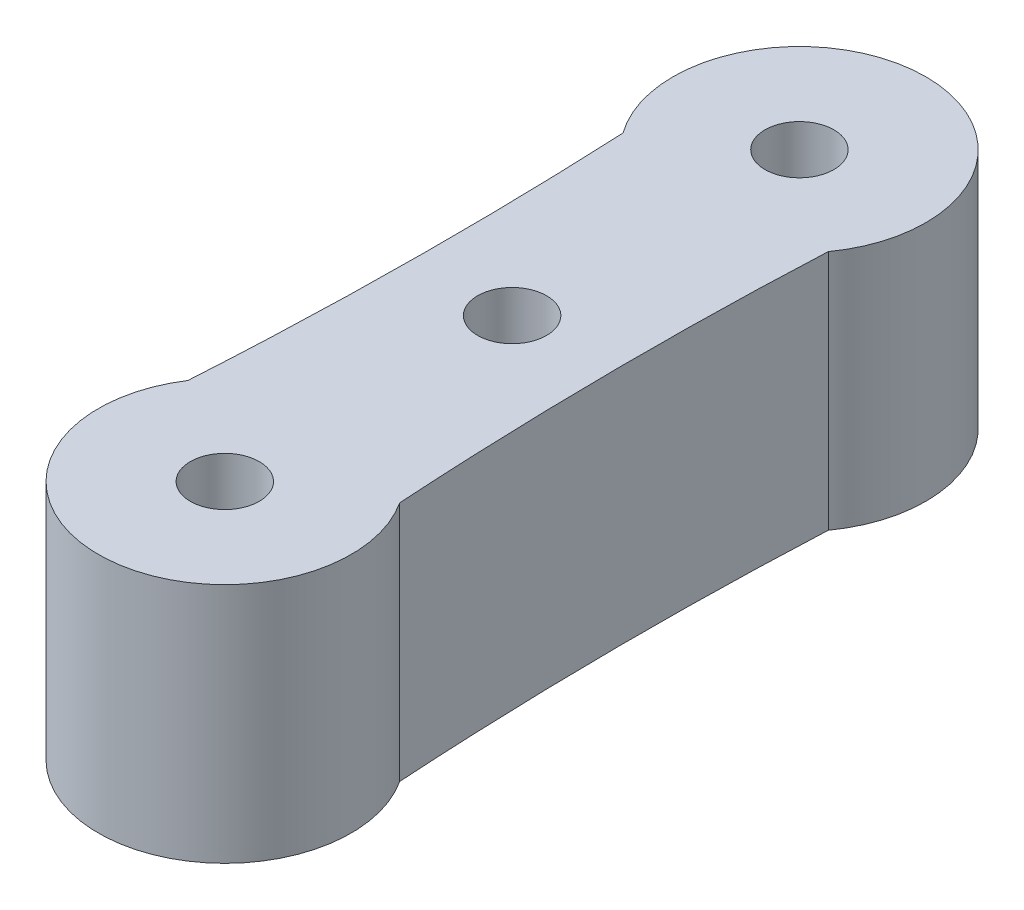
ISO-10303-21;
HEADER;
FILE_DESCRIPTION(('STEP AP214'),'2;1');
FILE_NAME('part.step','',(''),(''),'','','');
FILE_SCHEMA(('AUTOMOTIVE_DESIGN { 1 0 10303 214 1 1 1 1 }'));
ENDSEC;
DATA;
#1=APPLICATION_CONTEXT('core data for automotive mechanical design processes');
#2=APPLICATION_PROTOCOL_DEFINITION('international standard','automotive_design',2000,#1);
#3=PRODUCT_CONTEXT('',#1,'mechanical');
#4=PRODUCT('Part','Part','',(#3));
#5=PRODUCT_RELATED_PRODUCT_CATEGORY('part','',(#4));
#6=PRODUCT_DEFINITION_FORMATION('','',#4);
#7=PRODUCT_DEFINITION_CONTEXT('part definition',#1,'design');
#8=PRODUCT_DEFINITION('design','',#6,#7);
#9=PRODUCT_DEFINITION_SHAPE('','',#8);
#10=(LENGTH_UNIT() NAMED_UNIT(*) SI_UNIT(.MILLI.,.METRE.));
#11=(NAMED_UNIT(*) PLANE_ANGLE_UNIT() SI_UNIT($,.RADIAN.));
#12=(NAMED_UNIT(*) SI_UNIT($,.STERADIAN.) SOLID_ANGLE_UNIT());
#13=UNCERTAINTY_MEASURE_WITH_UNIT(LENGTH_MEASURE(1.E-05),#10,'distance_accuracy_value','');
#14=(GEOMETRIC_REPRESENTATION_CONTEXT(3) GLOBAL_UNCERTAINTY_ASSIGNED_CONTEXT((#13)) GLOBAL_UNIT_ASSIGNED_CONTEXT((#10,
#11,#12)) REPRESENTATION_CONTEXT('',''));
#15=CARTESIAN_POINT('',(0.,0.,0.));
#16=DIRECTION('',(0.,0.,1.));
#17=DIRECTION('',(1.,0.,0.));
#18=AXIS2_PLACEMENT_3D('',#15,#16,#17);
#19=CARTESIAN_POINT('',(0.,10.5,12.5));
#20=DIRECTION('',(0.,-1.,0.));
#21=DIRECTION('',(0.,0.,-1.));
#22=AXIS2_PLACEMENT_3D('',#19,#20,#21);
#23=CYLINDRICAL_SURFACE('',#22,1.5);
#24=CARTESIAN_POINT('',(0.,10.5,12.5));
#25=DIRECTION('',(0.,1.,0.));
#26=DIRECTION('',(0.,0.,1.));
#27=AXIS2_PLACEMENT_3D('',#24,#25,#26);
#28=CIRCLE('',#27,1.5);
#29=CARTESIAN_POINT('',(0.,10.5,11.));
#30=VERTEX_POINT('',#29);
#31=EDGE_CURVE('E293',#30,#30,#28,.T.);
#32=CARTESIAN_POINT('',(0.,3.5,12.5));
#33=DIRECTION('',(0.,-1.,0.));
#34=DIRECTION('',(0.,0.,-1.));
#35=AXIS2_PLACEMENT_3D('',#32,#33,#34);
#36=CIRCLE('',#35,1.5);
#37=CARTESIAN_POINT('',(0.,3.5,11.));
#38=VERTEX_POINT('',#37);
#39=EDGE_CURVE('E255',#38,#38,#36,.T.);
#40=CARTESIAN_POINT('',(0.,10.5,11.));
#41=CARTESIAN_POINT('',(0.,10.4270833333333,11.));
#42=CARTESIAN_POINT('',(0.,10.3541666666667,11.));
#43=CARTESIAN_POINT('',(0.,10.2083333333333,11.));
#44=CARTESIAN_POINT('',(0.,10.1354166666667,11.));
#45=CARTESIAN_POINT('',(0.,9.98958333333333,11.));
#46=CARTESIAN_POINT('',(0.,9.91666666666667,11.));
#47=CARTESIAN_POINT('',(0.,9.77083333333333,11.));
#48=CARTESIAN_POINT('',(0.,9.69791666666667,11.));
#49=CARTESIAN_POINT('',(0.,9.55208333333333,11.));
#50=CARTESIAN_POINT('',(0.,9.47916666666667,11.));
#51=CARTESIAN_POINT('',(0.,9.33333333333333,11.));
#52=CARTESIAN_POINT('',(0.,9.26041666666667,11.));
#53=CARTESIAN_POINT('',(0.,9.11458333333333,11.));
#54=CARTESIAN_POINT('',(0.,9.04166666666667,11.));
#55=CARTESIAN_POINT('',(0.,8.89583333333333,11.));
#56=CARTESIAN_POINT('',(0.,8.82291666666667,11.));
#57=CARTESIAN_POINT('',(0.,8.67708333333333,11.));
#58=CARTESIAN_POINT('',(0.,8.60416666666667,11.));
#59=CARTESIAN_POINT('',(0.,8.45833333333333,11.));
#60=CARTESIAN_POINT('',(0.,8.38541666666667,11.));
#61=CARTESIAN_POINT('',(0.,8.23958333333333,11.));
#62=CARTESIAN_POINT('',(0.,8.16666666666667,11.));
#63=CARTESIAN_POINT('',(0.,8.02083333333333,11.));
#64=CARTESIAN_POINT('',(0.,7.94791666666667,11.));
#65=CARTESIAN_POINT('',(0.,7.80208333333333,11.));
#66=CARTESIAN_POINT('',(0.,7.72916666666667,11.));
#67=CARTESIAN_POINT('',(0.,7.58333333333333,11.));
#68=CARTESIAN_POINT('',(0.,7.51041666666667,11.));
#69=CARTESIAN_POINT('',(0.,7.36458333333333,11.));
#70=CARTESIAN_POINT('',(0.,7.29166666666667,11.));
#71=CARTESIAN_POINT('',(0.,7.14583333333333,11.));
#72=CARTESIAN_POINT('',(0.,7.07291666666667,11.));
#73=CARTESIAN_POINT('',(0.,6.92708333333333,11.));
#74=CARTESIAN_POINT('',(0.,6.85416666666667,11.));
#75=CARTESIAN_POINT('',(0.,6.70833333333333,11.));
#76=CARTESIAN_POINT('',(0.,6.63541666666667,11.));
#77=CARTESIAN_POINT('',(0.,6.48958333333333,11.));
#78=CARTESIAN_POINT('',(0.,6.41666666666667,11.));
#79=CARTESIAN_POINT('',(0.,6.27083333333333,11.));
#80=CARTESIAN_POINT('',(0.,6.19791666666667,11.));
#81=CARTESIAN_POINT('',(0.,6.05208333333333,11.));
#82=CARTESIAN_POINT('',(0.,5.97916666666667,11.));
#83=CARTESIAN_POINT('',(0.,5.83333333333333,11.));
#84=CARTESIAN_POINT('',(0.,5.76041666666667,11.));
#85=CARTESIAN_POINT('',(0.,5.61458333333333,11.));
#86=CARTESIAN_POINT('',(0.,5.54166666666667,11.));
#87=CARTESIAN_POINT('',(0.,5.39583333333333,11.));
#88=CARTESIAN_POINT('',(0.,5.32291666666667,11.));
#89=CARTESIAN_POINT('',(0.,5.17708333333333,11.));
#90=CARTESIAN_POINT('',(0.,5.10416666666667,11.));
#91=CARTESIAN_POINT('',(0.,4.95833333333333,11.));
#92=CARTESIAN_POINT('',(0.,4.88541666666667,11.));
#93=CARTESIAN_POINT('',(0.,4.73958333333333,11.));
#94=CARTESIAN_POINT('',(0.,4.66666666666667,11.));
#95=CARTESIAN_POINT('',(0.,4.52083333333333,11.));
#96=CARTESIAN_POINT('',(0.,4.44791666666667,11.));
#97=CARTESIAN_POINT('',(0.,4.30208333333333,11.));
#98=CARTESIAN_POINT('',(0.,4.22916666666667,11.));
#99=CARTESIAN_POINT('',(0.,4.08333333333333,11.));
#100=CARTESIAN_POINT('',(0.,4.01041666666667,11.));
#101=CARTESIAN_POINT('',(0.,3.86458333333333,11.));
#102=CARTESIAN_POINT('',(0.,3.79166666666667,11.));
#103=CARTESIAN_POINT('',(0.,3.64583333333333,11.));
#104=CARTESIAN_POINT('',(0.,3.57291666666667,11.));
#105=CARTESIAN_POINT('',(0.,3.5,11.));
#106=B_SPLINE_CURVE_WITH_KNOTS('',3,(#40,#41,#42,#43,#44,#45,#46,#47,#48,#49,#50,#51,#52,#53,
#54,#55,#56,#57,#58,#59,#60,#61,#62,#63,#64,#65,#66,#67,#68,#69,#70,#71,#72,#73,#74,#75,#76,#77,
#78,#79,#80,#81,#82,#83,#84,#85,#86,#87,#88,#89,#90,#91,#92,#93,#94,#95,#96,#97,#98,#99,#100,
#101,#102,#103,#104,#105),.UNSPECIFIED.,.F.,.F.,(4,2,2,2,2,2,2,2,2,2,2,2,2,2,2,2,2,2,2,2,2,2,2,
2,2,2,2,2,2,2,2,2,4),(0.,0.21875,0.4375,0.656250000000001,0.875000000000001,1.09375,1.3125,
1.53125,1.75,1.96875,2.1875,2.40625,2.625,2.84375,3.0625,3.28125,3.5,3.71875,3.9375,4.15625,
4.375,4.59375,4.8125,5.03125,5.25,5.46875,5.6875,5.90625,6.125,6.34375,6.5625,6.78125,7.),.UNSPECIFIED.);
#107=EDGE_CURVE('BSEAM149',#30,#38,#106,.T.);
#108=ORIENTED_EDGE('',*,*,#31,.T.);
#109=ORIENTED_EDGE('',*,*,#39,.T.);
#110=ORIENTED_EDGE('',*,*,#107,.T.);
#111=ORIENTED_EDGE('',*,*,#107,.F.);
#112=EDGE_LOOP('',(#108,#110,#109,#111));
#113=FACE_BOUND('',#112,.T.);
#114=ADVANCED_FACE('F149',(#113),#23,.F.);
#115=CARTESIAN_POINT('',(0.,10.5,-12.5));
#116=DIRECTION('',(0.,-1.,0.));
#117=DIRECTION('',(0.,0.,-1.));
#118=AXIS2_PLACEMENT_3D('',#115,#116,#117);
#119=CYLINDRICAL_SURFACE('',#118,1.5);
#120=CARTESIAN_POINT('',(0.,10.5,-12.5));
#121=DIRECTION('',(0.,1.,0.));
#122=DIRECTION('',(0.,0.,1.));
#123=AXIS2_PLACEMENT_3D('',#120,#121,#122);
#124=CIRCLE('',#123,1.5);
#125=CARTESIAN_POINT('',(0.,10.5,-14.));
#126=VERTEX_POINT('',#125);
#127=EDGE_CURVE('E290',#126,#126,#124,.T.);
#128=CARTESIAN_POINT('',(0.,3.5,-12.5));
#129=DIRECTION('',(0.,-1.,0.));
#130=DIRECTION('',(0.,0.,-1.));
#131=AXIS2_PLACEMENT_3D('',#128,#129,#130);
#132=CIRCLE('',#131,1.5);
#133=CARTESIAN_POINT('',(0.,3.5,-14.));
#134=VERTEX_POINT('',#133);
#135=EDGE_CURVE('E248',#134,#134,#132,.T.);
#136=CARTESIAN_POINT('',(0.,10.5,-14.));
#137=CARTESIAN_POINT('',(0.,10.4270833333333,-14.));
#138=CARTESIAN_POINT('',(0.,10.3541666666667,-14.));
#139=CARTESIAN_POINT('',(0.,10.2083333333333,-14.));
#140=CARTESIAN_POINT('',(0.,10.1354166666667,-14.));
#141=CARTESIAN_POINT('',(0.,9.98958333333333,-14.));
#142=CARTESIAN_POINT('',(0.,9.91666666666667,-14.));
#143=CARTESIAN_POINT('',(0.,9.77083333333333,-14.));
#144=CARTESIAN_POINT('',(0.,9.69791666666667,-14.));
#145=CARTESIAN_POINT('',(0.,9.55208333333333,-14.));
#146=CARTESIAN_POINT('',(0.,9.47916666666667,-14.));
#147=CARTESIAN_POINT('',(0.,9.33333333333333,-14.));
#148=CARTESIAN_POINT('',(0.,9.26041666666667,-14.));
#149=CARTESIAN_POINT('',(0.,9.11458333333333,-14.));
#150=CARTESIAN_POINT('',(0.,9.04166666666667,-14.));
#151=CARTESIAN_POINT('',(0.,8.89583333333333,-14.));
#152=CARTESIAN_POINT('',(0.,8.82291666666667,-14.));
#153=CARTESIAN_POINT('',(0.,8.67708333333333,-14.));
#154=CARTESIAN_POINT('',(0.,8.60416666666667,-14.));
#155=CARTESIAN_POINT('',(0.,8.45833333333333,-14.));
#156=CARTESIAN_POINT('',(0.,8.38541666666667,-14.));
#157=CARTESIAN_POINT('',(0.,8.23958333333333,-14.));
#158=CARTESIAN_POINT('',(0.,8.16666666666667,-14.));
#159=CARTESIAN_POINT('',(0.,8.02083333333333,-14.));
#160=CARTESIAN_POINT('',(0.,7.94791666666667,-14.));
#161=CARTESIAN_POINT('',(0.,7.80208333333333,-14.));
#162=CARTESIAN_POINT('',(0.,7.72916666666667,-14.));
#163=CARTESIAN_POINT('',(0.,7.58333333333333,-14.));
#164=CARTESIAN_POINT('',(0.,7.51041666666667,-14.));
#165=CARTESIAN_POINT('',(0.,7.36458333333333,-14.));
#166=CARTESIAN_POINT('',(0.,7.29166666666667,-14.));
#167=CARTESIAN_POINT('',(0.,7.14583333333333,-14.));
#168=CARTESIAN_POINT('',(0.,7.07291666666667,-14.));
#169=CARTESIAN_POINT('',(0.,6.92708333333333,-14.));
#170=CARTESIAN_POINT('',(0.,6.85416666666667,-14.));
#171=CARTESIAN_POINT('',(0.,6.70833333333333,-14.));
#172=CARTESIAN_POINT('',(0.,6.63541666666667,-14.));
#173=CARTESIAN_POINT('',(0.,6.48958333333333,-14.));
#174=CARTESIAN_POINT('',(0.,6.41666666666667,-14.));
#175=CARTESIAN_POINT('',(0.,6.27083333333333,-14.));
#176=CARTESIAN_POINT('',(0.,6.19791666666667,-14.));
#177=CARTESIAN_POINT('',(0.,6.05208333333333,-14.));
#178=CARTESIAN_POINT('',(0.,5.97916666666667,-14.));
#179=CARTESIAN_POINT('',(0.,5.83333333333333,-14.));
#180=CARTESIAN_POINT('',(0.,5.76041666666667,-14.));
#181=CARTESIAN_POINT('',(0.,5.61458333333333,-14.));
#182=CARTESIAN_POINT('',(0.,5.54166666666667,-14.));
#183=CARTESIAN_POINT('',(0.,5.39583333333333,-14.));
#184=CARTESIAN_POINT('',(0.,5.32291666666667,-14.));
#185=CARTESIAN_POINT('',(0.,5.17708333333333,-14.));
#186=CARTESIAN_POINT('',(0.,5.10416666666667,-14.));
#187=CARTESIAN_POINT('',(0.,4.95833333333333,-14.));
#188=CARTESIAN_POINT('',(0.,4.88541666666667,-14.));
#189=CARTESIAN_POINT('',(0.,4.73958333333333,-14.));
#190=CARTESIAN_POINT('',(0.,4.66666666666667,-14.));
#191=CARTESIAN_POINT('',(0.,4.52083333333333,-14.));
#192=CARTESIAN_POINT('',(0.,4.44791666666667,-14.));
#193=CARTESIAN_POINT('',(0.,4.30208333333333,-14.));
#194=CARTESIAN_POINT('',(0.,4.22916666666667,-14.));
#195=CARTESIAN_POINT('',(0.,4.08333333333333,-14.));
#196=CARTESIAN_POINT('',(0.,4.01041666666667,-14.));
#197=CARTESIAN_POINT('',(0.,3.86458333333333,-14.));
#198=CARTESIAN_POINT('',(0.,3.79166666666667,-14.));
#199=CARTESIAN_POINT('',(0.,3.64583333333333,-14.));
#200=CARTESIAN_POINT('',(0.,3.57291666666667,-14.));
#201=CARTESIAN_POINT('',(0.,3.5,-14.));
#202=B_SPLINE_CURVE_WITH_KNOTS('',3,(#136,#137,#138,#139,#140,#141,#142,#143,#144,#145,#146,
#147,#148,#149,#150,#151,#152,#153,#154,#155,#156,#157,#158,#159,#160,#161,#162,#163,#164,#165,
#166,#167,#168,#169,#170,#171,#172,#173,#174,#175,#176,#177,#178,#179,#180,#181,#182,#183,#184,
#185,#186,#187,#188,#189,#190,#191,#192,#193,#194,#195,#196,#197,#198,#199,#200,#201),
.UNSPECIFIED.,.F.,.F.,(4,2,2,2,2,2,2,2,2,2,2,2,2,2,2,2,2,2,2,2,2,2,2,2,2,2,2,2,2,2,2,2,4),(0.,
0.21875,0.4375,0.656250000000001,0.875000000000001,1.09375,1.3125,1.53125,1.75,1.96875,2.1875,
2.40625,2.625,2.84375,3.0625,3.28125,3.5,3.71875,3.9375,4.15625,4.375,4.59375,4.8125,5.03125,
5.25,5.46875,5.6875,5.90625,6.125,6.34375,6.5625,6.78125,7.),.UNSPECIFIED.);
#203=EDGE_CURVE('BSEAM233',#126,#134,#202,.T.);
#204=ORIENTED_EDGE('',*,*,#127,.T.);
#205=ORIENTED_EDGE('',*,*,#135,.T.);
#206=ORIENTED_EDGE('',*,*,#203,.T.);
#207=ORIENTED_EDGE('',*,*,#203,.F.);
#208=EDGE_LOOP('',(#204,#206,#205,#207));
#209=FACE_BOUND('',#208,.T.);
#210=ADVANCED_FACE('F233',(#209),#119,.F.);
#211=CARTESIAN_POINT('',(0.,13.,0.));
#212=DIRECTION('',(0.,-1.,0.));
#213=DIRECTION('',(0.,0.,-1.));
#214=AXIS2_PLACEMENT_3D('',#211,#212,#213);
#215=CYLINDRICAL_SURFACE('',#214,1.5);
#216=CARTESIAN_POINT('',(0.,10.5,0.));
#217=DIRECTION('',(0.,1.,0.));
#218=DIRECTION('',(0.,0.,1.));
#219=AXIS2_PLACEMENT_3D('',#216,#217,#218);
#220=CIRCLE('',#219,1.5);
#221=CARTESIAN_POINT('',(0.,10.5,-1.5));
#222=VERTEX_POINT('',#221);
#223=EDGE_CURVE('E311',#222,#222,#220,.T.);
#224=CARTESIAN_POINT('',(0.,3.5,0.));
#225=DIRECTION('',(0.,-1.,0.));
#226=DIRECTION('',(0.,0.,-1.));
#227=AXIS2_PLACEMENT_3D('',#224,#225,#226);
#228=CIRCLE('',#227,1.5);
#229=CARTESIAN_POINT('',(0.,3.5,-1.5));
#230=VERTEX_POINT('',#229);
#231=EDGE_CURVE('E152',#230,#230,#228,.F.);
#232=CARTESIAN_POINT('',(0.,10.5,-1.5));
#233=CARTESIAN_POINT('',(0.,10.4270833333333,-1.5));
#234=CARTESIAN_POINT('',(0.,10.3541666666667,-1.5));
#235=CARTESIAN_POINT('',(0.,10.2083333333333,-1.5));
#236=CARTESIAN_POINT('',(0.,10.1354166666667,-1.5));
#237=CARTESIAN_POINT('',(0.,9.98958333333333,-1.5));
#238=CARTESIAN_POINT('',(0.,9.91666666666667,-1.5));
#239=CARTESIAN_POINT('',(0.,9.77083333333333,-1.5));
#240=CARTESIAN_POINT('',(0.,9.69791666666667,-1.5));
#241=CARTESIAN_POINT('',(0.,9.55208333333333,-1.5));
#242=CARTESIAN_POINT('',(0.,9.47916666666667,-1.5));
#243=CARTESIAN_POINT('',(0.,9.33333333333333,-1.5));
#244=CARTESIAN_POINT('',(0.,9.26041666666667,-1.5));
#245=CARTESIAN_POINT('',(0.,9.11458333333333,-1.5));
#246=CARTESIAN_POINT('',(0.,9.04166666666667,-1.5));
#247=CARTESIAN_POINT('',(0.,8.89583333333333,-1.5));
#248=CARTESIAN_POINT('',(0.,8.82291666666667,-1.5));
#249=CARTESIAN_POINT('',(0.,8.67708333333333,-1.5));
#250=CARTESIAN_POINT('',(0.,8.60416666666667,-1.5));
#251=CARTESIAN_POINT('',(0.,8.45833333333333,-1.5));
#252=CARTESIAN_POINT('',(0.,8.38541666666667,-1.5));
#253=CARTESIAN_POINT('',(0.,8.23958333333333,-1.5));
#254=CARTESIAN_POINT('',(0.,8.16666666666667,-1.5));
#255=CARTESIAN_POINT('',(0.,8.02083333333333,-1.5));
#256=CARTESIAN_POINT('',(0.,7.94791666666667,-1.5));
#257=CARTESIAN_POINT('',(0.,7.80208333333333,-1.5));
#258=CARTESIAN_POINT('',(0.,7.72916666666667,-1.5));
#259=CARTESIAN_POINT('',(0.,7.58333333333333,-1.5));
#260=CARTESIAN_POINT('',(0.,7.51041666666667,-1.5));
#261=CARTESIAN_POINT('',(0.,7.36458333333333,-1.5));
#262=CARTESIAN_POINT('',(0.,7.29166666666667,-1.5));
#263=CARTESIAN_POINT('',(0.,7.14583333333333,-1.5));
#264=CARTESIAN_POINT('',(0.,7.07291666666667,-1.5));
#265=CARTESIAN_POINT('',(0.,6.92708333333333,-1.5));
#266=CARTESIAN_POINT('',(0.,6.85416666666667,-1.5));
#267=CARTESIAN_POINT('',(0.,6.70833333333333,-1.5));
#268=CARTESIAN_POINT('',(0.,6.63541666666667,-1.5));
#269=CARTESIAN_POINT('',(0.,6.48958333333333,-1.5));
#270=CARTESIAN_POINT('',(0.,6.41666666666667,-1.5));
#271=CARTESIAN_POINT('',(0.,6.27083333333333,-1.5));
#272=CARTESIAN_POINT('',(0.,6.19791666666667,-1.5));
#273=CARTESIAN_POINT('',(0.,6.05208333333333,-1.5));
#274=CARTESIAN_POINT('',(0.,5.97916666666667,-1.5));
#275=CARTESIAN_POINT('',(0.,5.83333333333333,-1.5));
#276=CARTESIAN_POINT('',(0.,5.76041666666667,-1.5));
#277=CARTESIAN_POINT('',(0.,5.61458333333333,-1.5));
#278=CARTESIAN_POINT('',(0.,5.54166666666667,-1.5));
#279=CARTESIAN_POINT('',(0.,5.39583333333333,-1.5));
#280=CARTESIAN_POINT('',(0.,5.32291666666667,-1.5));
#281=CARTESIAN_POINT('',(0.,5.17708333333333,-1.5));
#282=CARTESIAN_POINT('',(0.,5.10416666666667,-1.5));
#283=CARTESIAN_POINT('',(0.,4.95833333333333,-1.5));
#284=CARTESIAN_POINT('',(0.,4.88541666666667,-1.5));
#285=CARTESIAN_POINT('',(0.,4.73958333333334,-1.5));
#286=CARTESIAN_POINT('',(0.,4.66666666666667,-1.5));
#287=CARTESIAN_POINT('',(0.,4.52083333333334,-1.5));
#288=CARTESIAN_POINT('',(0.,4.44791666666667,-1.5));
#289=CARTESIAN_POINT('',(0.,4.30208333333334,-1.5));
#290=CARTESIAN_POINT('',(0.,4.22916666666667,-1.5));
#291=CARTESIAN_POINT('',(0.,4.08333333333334,-1.5));
#292=CARTESIAN_POINT('',(0.,4.01041666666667,-1.5));
#293=CARTESIAN_POINT('',(0.,3.86458333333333,-1.5));
#294=CARTESIAN_POINT('',(0.,3.79166666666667,-1.5));
#295=CARTESIAN_POINT('',(0.,3.64583333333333,-1.5));
#296=CARTESIAN_POINT('',(0.,3.57291666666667,-1.5));
#297=CARTESIAN_POINT('',(0.,3.5,-1.5));
#298=B_SPLINE_CURVE_WITH_KNOTS('',3,(#232,#233,#234,#235,#236,#237,#238,#239,#240,#241,#242,
#243,#244,#245,#246,#247,#248,#249,#250,#251,#252,#253,#254,#255,#256,#257,#258,#259,#260,#261,
#262,#263,#264,#265,#266,#267,#268,#269,#270,#271,#272,#273,#274,#275,#276,#277,#278,#279,#280,
#281,#282,#283,#284,#285,#286,#287,#288,#289,#290,#291,#292,#293,#294,#295,#296,#297),
.UNSPECIFIED.,.F.,.F.,(4,2,2,2,2,2,2,2,2,2,2,2,2,2,2,2,2,2,2,2,2,2,2,2,2,2,2,2,2,2,2,2,4),(0.,
0.21875,0.4375,0.656250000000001,0.875000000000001,1.09375,1.3125,1.53125,1.75,1.96875,2.1875,
2.40625,2.625,2.84375,3.0625,3.28125,3.5,3.71875,3.9375,4.15625,4.375,4.59375,4.8125,5.03125,
5.25,5.46875,5.6875,5.90625,6.125,6.34375,6.5625,6.78125,7.),.UNSPECIFIED.);
#299=EDGE_CURVE('BSEAM229',#222,#230,#298,.T.);
#300=ORIENTED_EDGE('',*,*,#223,.T.);
#301=ORIENTED_EDGE('',*,*,#231,.F.);
#302=ORIENTED_EDGE('',*,*,#299,.T.);
#303=ORIENTED_EDGE('',*,*,#299,.F.);
#304=EDGE_LOOP('',(#300,#302,#301,#303));
#305=FACE_BOUND('',#304,.T.);
#306=ADVANCED_FACE('F229',(#305),#215,.F.);
#307=CARTESIAN_POINT('',(0.,10.5,-12.5));
#308=DIRECTION('',(0.,-1.,0.));
#309=DIRECTION('',(0.,0.,-1.));
#310=AXIS2_PLACEMENT_3D('',#307,#308,#309);
#311=CYLINDRICAL_SURFACE('',#310,5.5);
#312=CARTESIAN_POINT('',(0.,0.,-12.5));
#313=DIRECTION('',(0.,1.,0.));
#314=DIRECTION('',(0.,0.,1.));
#315=AXIS2_PLACEMENT_3D('',#312,#313,#314);
#316=CIRCLE('',#315,5.5);
#317=CARTESIAN_POINT('',(4.46618649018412,0.,-9.29014358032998));
#318=VERTEX_POINT('',#317);
#319=CARTESIAN_POINT('',(-4.46618649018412,0.,-9.29014358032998));
#320=VERTEX_POINT('',#319);
#321=EDGE_CURVE('E207',#318,#320,#316,.T.);
#322=ORIENTED_EDGE('',*,*,#321,.T.);
#323=DIRECTION('',(0.,-1.,0.));
#324=VECTOR('',#323,1.);
#325=CARTESIAN_POINT('',(-4.46618649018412,10.5,-9.29014358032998));
#326=LINE('',#325,#324);
#327=CARTESIAN_POINT('',(-4.46618649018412,10.5,-9.29014358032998));
#328=VERTEX_POINT('',#327);
#329=EDGE_CURVE('E158',#328,#320,#326,.T.);
#330=ORIENTED_EDGE('',*,*,#329,.F.);
#331=CARTESIAN_POINT('',(0.,10.5,-12.5));
#332=DIRECTION('',(0.,1.,0.));
#333=DIRECTION('',(0.,0.,1.));
#334=AXIS2_PLACEMENT_3D('',#331,#332,#333);
#335=CIRCLE('',#334,5.5);
#336=CARTESIAN_POINT('',(4.46618649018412,10.5,-9.29014358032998));
#337=VERTEX_POINT('',#336);
#338=EDGE_CURVE('E196',#337,#328,#335,.T.);
#339=ORIENTED_EDGE('',*,*,#338,.F.);
#340=DIRECTION('',(0.,-1.,0.));
#341=VECTOR('',#340,1.);
#342=CARTESIAN_POINT('',(4.46618649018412,10.5,-9.29014358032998));
#343=LINE('',#342,#341);
#344=EDGE_CURVE('E12',#337,#318,#343,.T.);
#345=ORIENTED_EDGE('',*,*,#344,.T.);
#346=EDGE_LOOP('',(#322,#330,#339,#345));
#347=FACE_BOUND('',#346,.T.);
#348=ADVANCED_FACE('F205',(#347),#311,.T.);
#349=CARTESIAN_POINT('',(-4.46618649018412,10.5,-9.29014358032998));
#350=CARTESIAN_POINT('',(-4.0222517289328,10.5,0.107844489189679));
#351=CARTESIAN_POINT('',(-4.60828596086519,10.5,9.49771745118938));
#352=B_SPLINE_CURVE_WITH_KNOTS('',2,(#349,#350,#351),.UNSPECIFIED.,.F.,.F.,(3,3),(0.,1.),.UNSPECIFIED.);
#353=DIRECTION('',(0.,-1.,0.));
#354=VECTOR('',#353,1.);
#355=SURFACE_OF_LINEAR_EXTRUSION('',#352,#354);
#356=CARTESIAN_POINT('',(-4.46618649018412,0.,-9.29014358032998));
#357=CARTESIAN_POINT('',(-4.0222517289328,0.,0.107844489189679));
#358=CARTESIAN_POINT('',(-4.60828596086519,0.,9.49771745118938));
#359=B_SPLINE_CURVE_WITH_KNOTS('',2,(#356,#357,#358),.UNSPECIFIED.,.F.,.F.,(3,3),(0.,1.),.UNSPECIFIED.);
#360=CARTESIAN_POINT('',(-4.60828596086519,0.,9.49771745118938));
#361=VERTEX_POINT('',#360);
#362=EDGE_CURVE('E183',#320,#361,#359,.T.);
#363=ORIENTED_EDGE('',*,*,#362,.T.);
#364=DIRECTION('',(0.,-1.,0.));
#365=VECTOR('',#364,1.);
#366=CARTESIAN_POINT('',(-4.60828596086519,10.5,9.49771745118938));
#367=LINE('',#366,#365);
#368=CARTESIAN_POINT('',(-4.60828596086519,10.5,9.49771745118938));
#369=VERTEX_POINT('',#368);
#370=EDGE_CURVE('E208',#369,#361,#367,.T.);
#371=ORIENTED_EDGE('',*,*,#370,.F.);
#372=EDGE_CURVE('E201',#328,#369,#352,.T.);
#373=ORIENTED_EDGE('',*,*,#372,.F.);
#374=ORIENTED_EDGE('',*,*,#329,.T.);
#375=EDGE_LOOP('',(#363,#371,#373,#374));
#376=FACE_BOUND('',#375,.T.);
#377=ADVANCED_FACE('F210',(#376),#355,.F.);
#378=CARTESIAN_POINT('',(0.,10.5,12.5));
#379=DIRECTION('',(0.,-1.,0.));
#380=DIRECTION('',(0.,0.,-1.));
#381=AXIS2_PLACEMENT_3D('',#378,#379,#380);
#382=CYLINDRICAL_SURFACE('',#381,5.5);
#383=CARTESIAN_POINT('',(0.,0.,12.5));
#384=DIRECTION('',(0.,1.,0.));
#385=DIRECTION('',(0.,0.,1.));
#386=AXIS2_PLACEMENT_3D('',#383,#384,#385);
#387=CIRCLE('',#386,5.5);
#388=CARTESIAN_POINT('',(4.60828596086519,0.,9.49771745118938));
#389=VERTEX_POINT('',#388);
#390=EDGE_CURVE('E238',#361,#389,#387,.T.);
#391=ORIENTED_EDGE('',*,*,#390,.T.);
#392=DIRECTION('',(0.,-1.,0.));
#393=VECTOR('',#392,1.);
#394=CARTESIAN_POINT('',(4.60828596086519,10.5,9.49771745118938));
#395=LINE('',#394,#393);
#396=CARTESIAN_POINT('',(4.60828596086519,10.5,9.49771745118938));
#397=VERTEX_POINT('',#396);
#398=EDGE_CURVE('E190',#397,#389,#395,.T.);
#399=ORIENTED_EDGE('',*,*,#398,.F.);
#400=CARTESIAN_POINT('',(0.,10.5,12.5));
#401=DIRECTION('',(0.,1.,0.));
#402=DIRECTION('',(0.,0.,1.));
#403=AXIS2_PLACEMENT_3D('',#400,#401,#402);
#404=CIRCLE('',#403,5.5);
#405=EDGE_CURVE('E167',#369,#397,#404,.T.);
#406=ORIENTED_EDGE('',*,*,#405,.F.);
#407=ORIENTED_EDGE('',*,*,#370,.T.);
#408=EDGE_LOOP('',(#391,#399,#406,#407));
#409=FACE_BOUND('',#408,.T.);
#410=ADVANCED_FACE('F225',(#409),#382,.T.);
#411=CARTESIAN_POINT('',(4.46618649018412,10.5,-9.29014358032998));
#412=CARTESIAN_POINT('',(4.0222517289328,10.5,0.107844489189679));
#413=CARTESIAN_POINT('',(4.60828596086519,10.5,9.49771745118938));
#414=B_SPLINE_CURVE_WITH_KNOTS('',2,(#411,#412,#413),.UNSPECIFIED.,.F.,.F.,(3,3),(0.,1.),.UNSPECIFIED.);
#415=DIRECTION('',(0.,-1.,0.));
#416=VECTOR('',#415,1.);
#417=SURFACE_OF_LINEAR_EXTRUSION('',#414,#416);
#418=CARTESIAN_POINT('',(4.46618649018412,0.,-9.29014358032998));
#419=CARTESIAN_POINT('',(4.0222517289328,0.,0.107844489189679));
#420=CARTESIAN_POINT('',(4.60828596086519,0.,9.49771745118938));
#421=B_SPLINE_CURVE_WITH_KNOTS('',2,(#418,#419,#420),.UNSPECIFIED.,.F.,.F.,(3,3),(0.,1.),.UNSPECIFIED.);
#422=EDGE_CURVE('E289',#318,#389,#421,.T.);
#423=ORIENTED_EDGE('',*,*,#422,.F.);
#424=ORIENTED_EDGE('',*,*,#344,.F.);
#425=EDGE_CURVE('E202',#337,#397,#414,.T.);
#426=ORIENTED_EDGE('',*,*,#425,.T.);
#427=ORIENTED_EDGE('',*,*,#398,.T.);
#428=EDGE_LOOP('',(#423,#424,#426,#427));
#429=FACE_BOUND('',#428,.T.);
#430=ADVANCED_FACE('F230',(#429),#417,.T.);
#431=CARTESIAN_POINT('',(0.,0.,0.));
#432=DIRECTION('',(0.,1.,0.));
#433=DIRECTION('',(0.,0.,1.));
#434=AXIS2_PLACEMENT_3D('',#431,#432,#433);
#435=PLANE('',#434);
#436=CARTESIAN_POINT('',(0.,0.,12.5));
#437=DIRECTION('',(0.,-1.,0.));
#438=DIRECTION('',(0.,0.,-1.));
#439=AXIS2_PLACEMENT_3D('',#436,#437,#438);
#440=CIRCLE('',#439,3.);
#441=CARTESIAN_POINT('',(0.,0.,9.5));
#442=VERTEX_POINT('',#441);
#443=EDGE_CURVE('E258',#442,#442,#440,.T.);
#444=ORIENTED_EDGE('',*,*,#443,.F.);
#445=EDGE_LOOP('',(#444));
#446=FACE_BOUND('',#445,.T.);
#447=CARTESIAN_POINT('',(0.,0.,-12.5));
#448=DIRECTION('',(0.,-1.,0.));
#449=DIRECTION('',(0.,0.,-1.));
#450=AXIS2_PLACEMENT_3D('',#447,#448,#449);
#451=CIRCLE('',#450,3.);
#452=CARTESIAN_POINT('',(0.,0.,-15.5));
#453=VERTEX_POINT('',#452);
#454=EDGE_CURVE('E249',#453,#453,#451,.T.);
#455=ORIENTED_EDGE('',*,*,#454,.F.);
#456=EDGE_LOOP('',(#455));
#457=FACE_BOUND('',#456,.T.);
#458=CARTESIAN_POINT('',(0.,0.,0.));
#459=DIRECTION('',(0.,-1.,0.));
#460=DIRECTION('',(0.,0.,-1.));
#461=AXIS2_PLACEMENT_3D('',#458,#459,#460);
#462=CIRCLE('',#461,3.);
#463=CARTESIAN_POINT('',(0.,0.,-3.));
#464=VERTEX_POINT('',#463);
#465=EDGE_CURVE('E239',#464,#464,#462,.T.);
#466=ORIENTED_EDGE('',*,*,#465,.F.);
#467=EDGE_LOOP('',(#466));
#468=FACE_BOUND('',#467,.T.);
#469=ORIENTED_EDGE('',*,*,#422,.T.);
#470=ORIENTED_EDGE('',*,*,#390,.F.);
#471=ORIENTED_EDGE('',*,*,#362,.F.);
#472=ORIENTED_EDGE('',*,*,#321,.F.);
#473=EDGE_LOOP('',(#469,#470,#471,#472));
#474=FACE_BOUND('',#473,.T.);
#475=ADVANCED_FACE('F232',(#446,#457,#468,#474),#435,.F.);
#476=CARTESIAN_POINT('',(0.,10.5,0.));
#477=DIRECTION('',(0.,1.,0.));
#478=DIRECTION('',(0.,0.,1.));
#479=AXIS2_PLACEMENT_3D('',#476,#477,#478);
#480=PLANE('',#479);
#481=ORIENTED_EDGE('',*,*,#223,.F.);
#482=EDGE_LOOP('',(#481));
#483=FACE_BOUND('',#482,.T.);
#484=ORIENTED_EDGE('',*,*,#425,.F.);
#485=ORIENTED_EDGE('',*,*,#338,.T.);
#486=ORIENTED_EDGE('',*,*,#372,.T.);
#487=ORIENTED_EDGE('',*,*,#405,.T.);
#488=EDGE_LOOP('',(#484,#485,#486,#487));
#489=FACE_BOUND('',#488,.T.);
#490=ORIENTED_EDGE('',*,*,#127,.F.);
#491=EDGE_LOOP('',(#490));
#492=FACE_BOUND('',#491,.T.);
#493=ORIENTED_EDGE('',*,*,#31,.F.);
#494=EDGE_LOOP('',(#493));
#495=FACE_BOUND('',#494,.T.);
#496=ADVANCED_FACE('F198',(#483,#489,#492,#495),#480,.T.);
#497=CARTESIAN_POINT('',(0.,3.5,0.));
#498=DIRECTION('',(0.,-1.,0.));
#499=DIRECTION('',(0.,0.,-1.));
#500=AXIS2_PLACEMENT_3D('',#497,#498,#499);
#501=PLANE('',#500);
#502=CARTESIAN_POINT('',(0.,3.5,0.));
#503=DIRECTION('',(0.,-1.,0.));
#504=DIRECTION('',(0.,0.,-1.));
#505=AXIS2_PLACEMENT_3D('',#502,#503,#504);
#506=CIRCLE('',#505,3.);
#507=CARTESIAN_POINT('',(0.,3.5,-3.));
#508=VERTEX_POINT('',#507);
#509=EDGE_CURVE('E245',#508,#508,#506,.T.);
#510=ORIENTED_EDGE('',*,*,#509,.T.);
#511=EDGE_LOOP('',(#510));
#512=FACE_BOUND('',#511,.T.);
#513=ORIENTED_EDGE('',*,*,#231,.T.);
#514=EDGE_LOOP('',(#513));
#515=FACE_BOUND('',#514,.T.);
#516=ADVANCED_FACE('F318',(#512,#515),#501,.T.);
#517=CARTESIAN_POINT('',(0.,3.5,0.));
#518=DIRECTION('',(0.,-1.,0.));
#519=DIRECTION('',(0.,0.,-1.));
#520=AXIS2_PLACEMENT_3D('',#517,#518,#519);
#521=CYLINDRICAL_SURFACE('',#520,3.);
#522=ORIENTED_EDGE('',*,*,#509,.F.);
#523=EDGE_LOOP('',(#522));
#524=FACE_BOUND('',#523,.T.);
#525=ORIENTED_EDGE('',*,*,#465,.T.);
#526=EDGE_LOOP('',(#525));
#527=FACE_BOUND('',#526,.T.);
#528=ADVANCED_FACE('F339',(#524,#527),#521,.F.);
#529=CARTESIAN_POINT('',(0.,3.5,-12.5));
#530=DIRECTION('',(0.,-1.,0.));
#531=DIRECTION('',(0.,0.,-1.));
#532=AXIS2_PLACEMENT_3D('',#529,#530,#531);
#533=CYLINDRICAL_SURFACE('',#532,3.);
#534=CARTESIAN_POINT('',(0.,3.5,-12.5));
#535=DIRECTION('',(0.,-1.,0.));
#536=DIRECTION('',(0.,0.,-1.));
#537=AXIS2_PLACEMENT_3D('',#534,#535,#536);
#538=CIRCLE('',#537,3.);
#539=CARTESIAN_POINT('',(0.,3.5,-15.5));
#540=VERTEX_POINT('',#539);
#541=EDGE_CURVE('E252',#540,#540,#538,.T.);
#542=ORIENTED_EDGE('',*,*,#541,.F.);
#543=EDGE_LOOP('',(#542));
#544=FACE_BOUND('',#543,.T.);
#545=ORIENTED_EDGE('',*,*,#454,.T.);
#546=EDGE_LOOP('',(#545));
#547=FACE_BOUND('',#546,.T.);
#548=ADVANCED_FACE('F345',(#544,#547),#533,.F.);
#549=CARTESIAN_POINT('',(0.,3.5,-12.5));
#550=DIRECTION('',(0.,-1.,0.));
#551=DIRECTION('',(0.,0.,-1.));
#552=AXIS2_PLACEMENT_3D('',#549,#550,#551);
#553=PLANE('',#552);
#554=ORIENTED_EDGE('',*,*,#135,.F.);
#555=EDGE_LOOP('',(#554));
#556=FACE_BOUND('',#555,.T.);
#557=ORIENTED_EDGE('',*,*,#541,.T.);
#558=EDGE_LOOP('',(#557));
#559=FACE_BOUND('',#558,.T.);
#560=ADVANCED_FACE('F277',(#556,#559),#553,.T.);
#561=CARTESIAN_POINT('',(0.,3.5,12.5));
#562=DIRECTION('',(0.,-1.,0.));
#563=DIRECTION('',(0.,0.,-1.));
#564=AXIS2_PLACEMENT_3D('',#561,#562,#563);
#565=CYLINDRICAL_SURFACE('',#564,3.);
#566=CARTESIAN_POINT('',(0.,3.5,12.5));
#567=DIRECTION('',(0.,-1.,0.));
#568=DIRECTION('',(0.,0.,-1.));
#569=AXIS2_PLACEMENT_3D('',#566,#567,#568);
#570=CIRCLE('',#569,3.);
#571=CARTESIAN_POINT('',(0.,3.5,9.5));
#572=VERTEX_POINT('',#571);
#573=EDGE_CURVE('E261',#572,#572,#570,.T.);
#574=ORIENTED_EDGE('',*,*,#573,.F.);
#575=EDGE_LOOP('',(#574));
#576=FACE_BOUND('',#575,.T.);
#577=ORIENTED_EDGE('',*,*,#443,.T.);
#578=EDGE_LOOP('',(#577));
#579=FACE_BOUND('',#578,.T.);
#580=ADVANCED_FACE('F271',(#576,#579),#565,.F.);
#581=CARTESIAN_POINT('',(0.,3.5,12.5));
#582=DIRECTION('',(0.,-1.,0.));
#583=DIRECTION('',(0.,0.,-1.));
#584=AXIS2_PLACEMENT_3D('',#581,#582,#583);
#585=PLANE('',#584);
#586=ORIENTED_EDGE('',*,*,#39,.F.);
#587=EDGE_LOOP('',(#586));
#588=FACE_BOUND('',#587,.T.);
#589=ORIENTED_EDGE('',*,*,#573,.T.);
#590=EDGE_LOOP('',(#589));
#591=FACE_BOUND('',#590,.T.);
#592=ADVANCED_FACE('F268',(#588,#591),#585,.T.);
#593=CLOSED_SHELL('',(#114,#210,#306,#348,#377,#410,#430,#475,#496,#516,#528,#548,#560,#580,#592));
#594=MANIFOLD_SOLID_BREP('B2',#593);
#595=ADVANCED_BREP_SHAPE_REPRESENTATION('',(#18,#594),#14);
#596=SHAPE_DEFINITION_REPRESENTATION(#9,#595);
ENDSEC;
END-ISO-10303-21;
